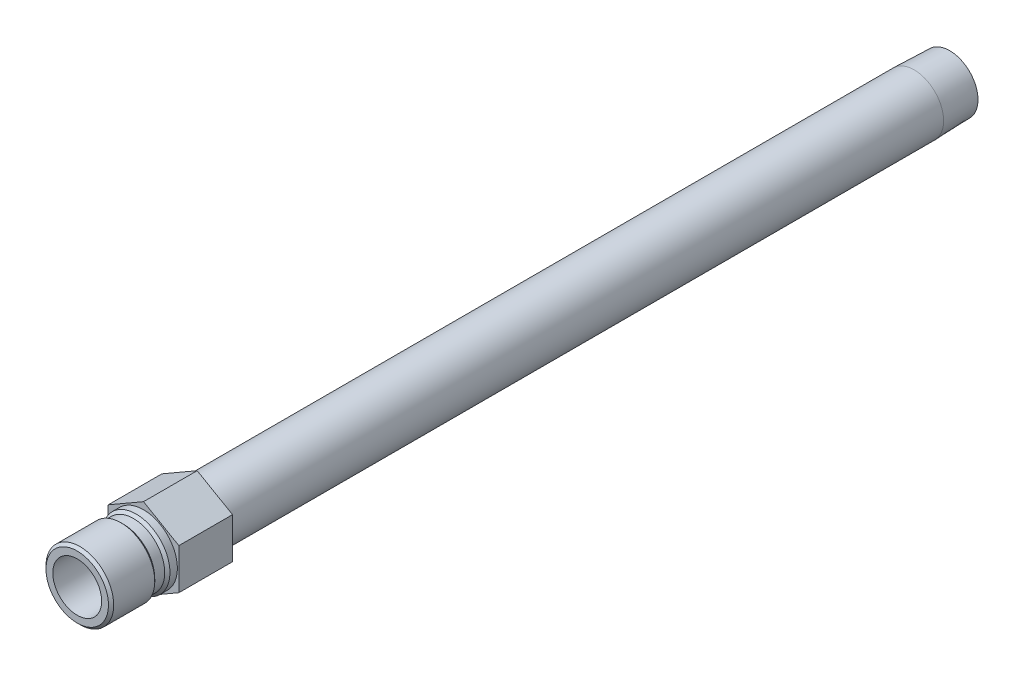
from build123d import *

# Parameters (mm, degrees)
SKETCH2_R           = 7.112
BOSS_EXTRUDE1_DEPTH = 15.621


with BuildPart() as part:
    # Sketch1 → Revolve1 (revolve)
    with BuildSketch(Plane(origin=(0, 0, 0), x_dir=(0, 0, -1), z_dir=(1, 0, 0))):
        Polygon((-19.304, 7.112), (-19.304, 9.0932), (-18.542, 9.8552), (-6.5786, 9.8552), (-5.8166, 9.0932), (-2.921, 9.0932), (-2.159, 9.8552), (0, 9.8552), (0, 8.5725), (224.3582, 8.5725), (234.696, 8.249445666), (234.696, 6.2611), (-1.071568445, 6.2611), (-1.524, 7.112), align=None)
    revolve(axis=Axis((0, 0, 0), (0, 0, 1)))

    # Sketch2 → Boss-Extrude1 (add)
    with BuildSketch(Plane.XY):
        Polygon((-10.287, 5.939202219), (-10.287, -5.939202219), (0, -11.878404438), (10.287, -5.939202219), (10.287, 5.939202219), (0, 11.878404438), align=None)
        with Locations(Location((0, 0, 0), (0, 0, 90))):
            Circle(SKETCH2_R, mode=Mode.SUBTRACT)
    extrude(amount=-BOSS_EXTRUDE1_DEPTH)


solid = part.part
